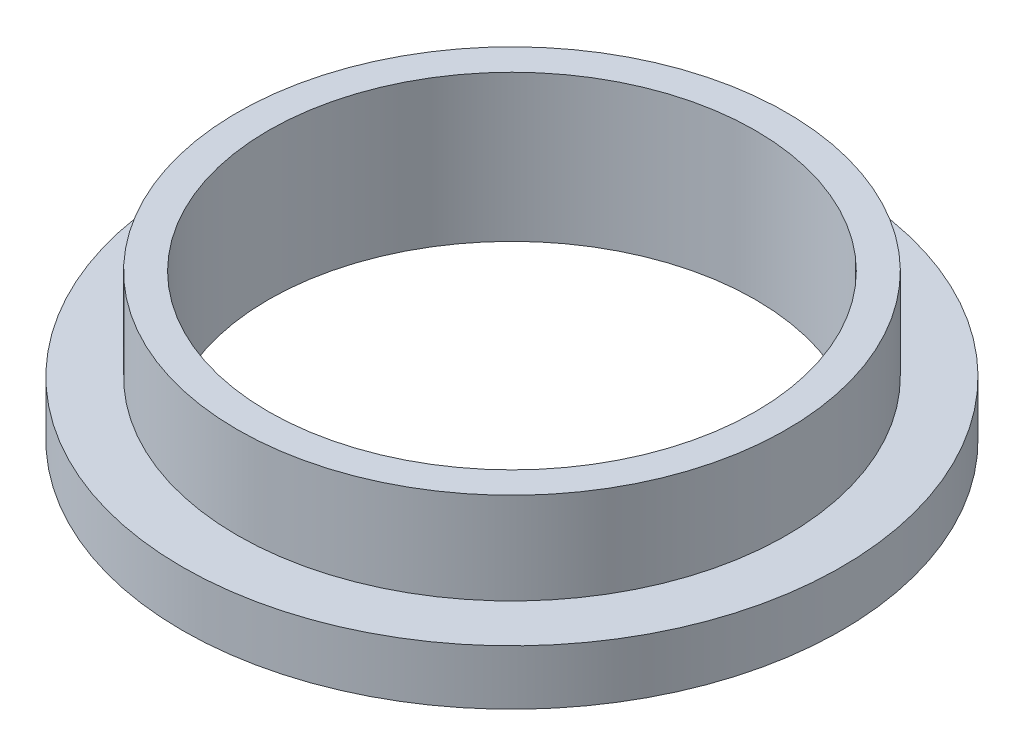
from build123d import *

# Parameters (mm, degrees)
SKETCH2_R           = 7.5
SKETCH2_R_2         = 6
BOSS_EXTRUDE1_DEPTH = 8
SKETCH3_R           = 9
SKETCH3_R_2         = 7.5
BOSS_EXTRUDE2_DEPTH = 1.5
SKETCH4_R           = 6.65
CUT_EXTRUDE1_DEPTH  = 10
SKETCH5_R           = 10.494515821
CUT_EXTRUDE2_DEPTH  = 4


with BuildPart() as part:
    # Sketch2 → Boss-Extrude1 (new body)
    with BuildSketch(Plane(origin=(0, 0, 0), x_dir=(1, 0, 0), z_dir=(0, 1, 0))):
        with Locations(Location((0, 0, 0), (0, 0, 270))):
            Circle(SKETCH2_R)
        with Locations(Location((0, 0, 0), (0, 0, 270))):
            Circle(SKETCH2_R_2, mode=Mode.SUBTRACT)
    extrude(amount=BOSS_EXTRUDE1_DEPTH)

    # Sketch3 → Boss-Extrude2 (add)
    with BuildSketch(Plane(origin=(0, 0, 0), x_dir=(1, 0, 0), z_dir=(0, 1, 0))):
        with Locations(Location((0, 0, 0), (0, 0, 270))):
            Circle(SKETCH3_R)
        with Locations(Location((0, 0, 0), (0, 0, 270))):
            Circle(SKETCH3_R_2, mode=Mode.SUBTRACT)
    extrude(amount=BOSS_EXTRUDE2_DEPTH)

    # Sketch4 → Cut-Extrude1 (cut)
    with BuildSketch(Plane(origin=(0, 8, 0), x_dir=(1, 0, 0), z_dir=(0, 1, 0))):
        with Locations(Location((0, 0, 0), (0, 0, 270))):
            Circle(SKETCH4_R)
    extrude(amount=-CUT_EXTRUDE1_DEPTH, mode=Mode.SUBTRACT)

    # Sketch5 → Cut-Extrude2 (cut)
    with BuildSketch(Plane(origin=(0, 8, 0), x_dir=(1, 0, 0), z_dir=(0, 1, 0))):
        Circle(SKETCH5_R)
    extrude(amount=-CUT_EXTRUDE2_DEPTH, mode=Mode.SUBTRACT)


solid = part.part
